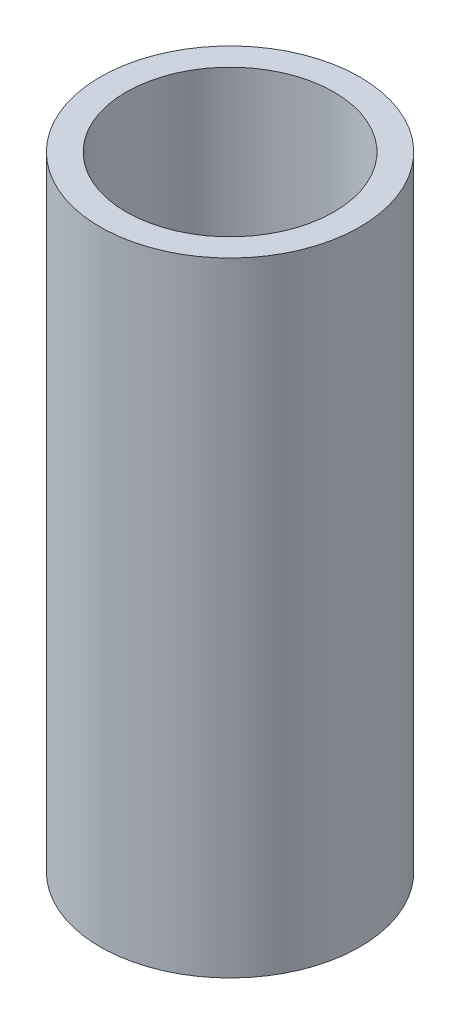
from build123d import *

# Parameters (mm, degrees)
SKETCH1_R           = 15.875
SKETCH1_R_2         = 12.7
BOSS_EXTRUDE1_DEPTH = 76.2


with BuildPart() as part:
    # Sketch1 → Boss-Extrude1 (new body)
    with BuildSketch(Plane(origin=(0, 0, 0), x_dir=(1, 0, 0), z_dir=(0, 1, 0))):
        with Locations(Location((0, 0, 0), (0, 0, 90))):
            Circle(SKETCH1_R)
        with Locations(Location((0, 0, 0), (0, 0, 90))):
            Circle(SKETCH1_R_2, mode=Mode.SUBTRACT)
    extrude(amount=BOSS_EXTRUDE1_DEPTH)


solid = part.part
